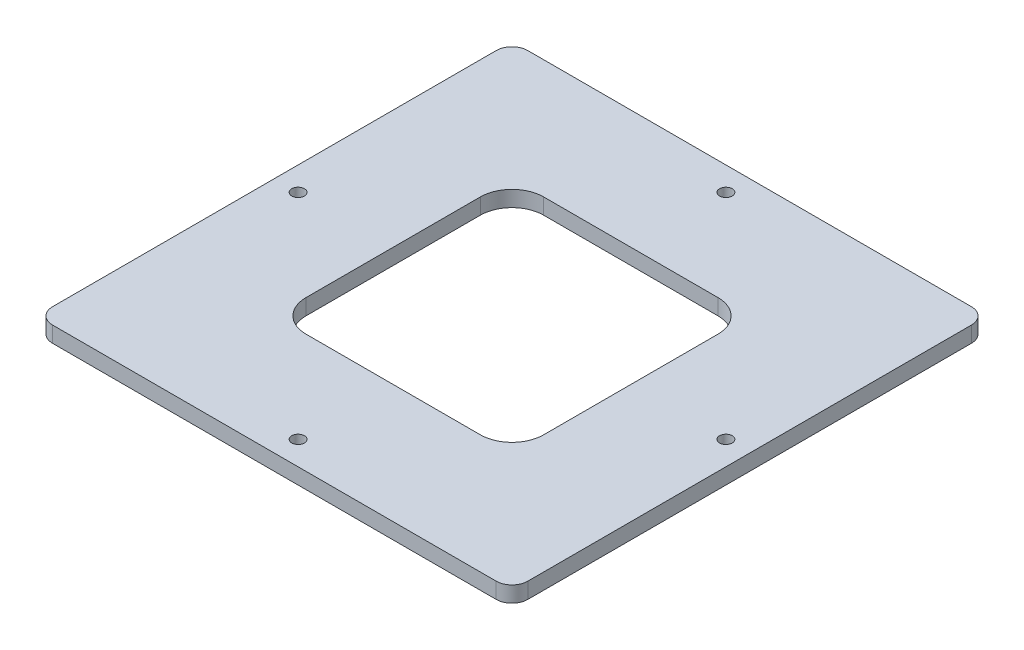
ISO-10303-21;
HEADER;
FILE_DESCRIPTION(('STEP AP214'),'2;1');
FILE_NAME('part.step','',(''),(''),'','','');
FILE_SCHEMA(('AUTOMOTIVE_DESIGN { 1 0 10303 214 1 1 1 1 }'));
ENDSEC;
DATA;
#1=APPLICATION_CONTEXT('core data for automotive mechanical design processes');
#2=APPLICATION_PROTOCOL_DEFINITION('international standard','automotive_design',2000,#1);
#3=PRODUCT_CONTEXT('',#1,'mechanical');
#4=PRODUCT('Part','Part','',(#3));
#5=PRODUCT_RELATED_PRODUCT_CATEGORY('part','',(#4));
#6=PRODUCT_DEFINITION_FORMATION('','',#4);
#7=PRODUCT_DEFINITION_CONTEXT('part definition',#1,'design');
#8=PRODUCT_DEFINITION('design','',#6,#7);
#9=PRODUCT_DEFINITION_SHAPE('','',#8);
#10=(LENGTH_UNIT() NAMED_UNIT(*) SI_UNIT(.MILLI.,.METRE.));
#11=(NAMED_UNIT(*) PLANE_ANGLE_UNIT() SI_UNIT($,.RADIAN.));
#12=(NAMED_UNIT(*) SI_UNIT($,.STERADIAN.) SOLID_ANGLE_UNIT());
#13=UNCERTAINTY_MEASURE_WITH_UNIT(LENGTH_MEASURE(1.E-05),#10,'distance_accuracy_value','');
#14=(GEOMETRIC_REPRESENTATION_CONTEXT(3) GLOBAL_UNCERTAINTY_ASSIGNED_CONTEXT((#13)) GLOBAL_UNIT_ASSIGNED_CONTEXT((#10,
#11,#12)) REPRESENTATION_CONTEXT('',''));
#15=CARTESIAN_POINT('',(0.,0.,0.));
#16=DIRECTION('',(0.,0.,1.));
#17=DIRECTION('',(1.,0.,0.));
#18=AXIS2_PLACEMENT_3D('',#15,#16,#17);
#19=CARTESIAN_POINT('',(-56.,4.,56.));
#20=DIRECTION('',(0.,1.,0.));
#21=DIRECTION('',(0.,0.,1.));
#22=AXIS2_PLACEMENT_3D('',#19,#20,#21);
#23=PLANE('',#22);
#24=CARTESIAN_POINT('',(0.,4.,54.));
#25=DIRECTION('',(0.,1.,0.));
#26=DIRECTION('',(0.,0.,1.));
#27=AXIS2_PLACEMENT_3D('',#24,#25,#26);
#28=CIRCLE('',#27,1.6);
#29=CARTESIAN_POINT('',(0.,4.,55.6));
#30=VERTEX_POINT('',#29);
#31=EDGE_CURVE('E389',#30,#30,#28,.T.);
#32=ORIENTED_EDGE('',*,*,#31,.F.);
#33=EDGE_LOOP('',(#32));
#34=FACE_BOUND('',#33,.T.);
#35=CARTESIAN_POINT('',(0.,4.,-54.));
#36=DIRECTION('',(0.,1.,0.));
#37=DIRECTION('',(0.,0.,1.));
#38=AXIS2_PLACEMENT_3D('',#35,#36,#37);
#39=CIRCLE('',#38,1.6);
#40=CARTESIAN_POINT('',(0.,4.,-52.4));
#41=VERTEX_POINT('',#40);
#42=EDGE_CURVE('E184',#41,#41,#39,.T.);
#43=ORIENTED_EDGE('',*,*,#42,.F.);
#44=EDGE_LOOP('',(#43));
#45=FACE_BOUND('',#44,.T.);
#46=CARTESIAN_POINT('',(-56.,4.,56.));
#47=DIRECTION('',(0.,1.,0.));
#48=DIRECTION('',(0.,0.,1.));
#49=AXIS2_PLACEMENT_3D('',#46,#47,#48);
#50=CIRCLE('',#49,4.00000000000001);
#51=CARTESIAN_POINT('',(-60.,4.,56.));
#52=VERTEX_POINT('',#51);
#53=CARTESIAN_POINT('',(-56.,4.,60.));
#54=VERTEX_POINT('',#53);
#55=EDGE_CURVE('E214',#52,#54,#50,.T.);
#56=ORIENTED_EDGE('',*,*,#55,.T.);
#57=DIRECTION('',(1.,0.,0.));
#58=VECTOR('',#57,1.);
#59=CARTESIAN_POINT('',(-56.,4.,60.));
#60=LINE('',#59,#58);
#61=CARTESIAN_POINT('',(56.,4.,60.));
#62=VERTEX_POINT('',#61);
#63=EDGE_CURVE('E217',#54,#62,#60,.T.);
#64=ORIENTED_EDGE('',*,*,#63,.T.);
#65=CARTESIAN_POINT('',(56.,4.,56.));
#66=DIRECTION('',(0.,1.,0.));
#67=DIRECTION('',(0.,0.,-1.));
#68=AXIS2_PLACEMENT_3D('',#65,#66,#67);
#69=CIRCLE('',#68,4.00000000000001);
#70=CARTESIAN_POINT('',(60.,4.,56.));
#71=VERTEX_POINT('',#70);
#72=EDGE_CURVE('E220',#62,#71,#69,.T.);
#73=ORIENTED_EDGE('',*,*,#72,.T.);
#74=DIRECTION('',(0.,0.,-1.));
#75=VECTOR('',#74,1.);
#76=CARTESIAN_POINT('',(60.,4.,-56.));
#77=LINE('',#76,#75);
#78=CARTESIAN_POINT('',(60.,4.,-56.));
#79=VERTEX_POINT('',#78);
#80=EDGE_CURVE('E222',#71,#79,#77,.T.);
#81=ORIENTED_EDGE('',*,*,#80,.T.);
#82=CARTESIAN_POINT('',(56.,4.,-56.));
#83=DIRECTION('',(0.,1.,0.));
#84=DIRECTION('',(0.,0.,-1.));
#85=AXIS2_PLACEMENT_3D('',#82,#83,#84);
#86=CIRCLE('',#85,4.00000000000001);
#87=CARTESIAN_POINT('',(56.,4.,-60.));
#88=VERTEX_POINT('',#87);
#89=EDGE_CURVE('E224',#79,#88,#86,.T.);
#90=ORIENTED_EDGE('',*,*,#89,.T.);
#91=DIRECTION('',(-1.,0.,0.));
#92=VECTOR('',#91,1.);
#93=CARTESIAN_POINT('',(-56.,4.,-60.));
#94=LINE('',#93,#92);
#95=CARTESIAN_POINT('',(-56.,4.,-60.));
#96=VERTEX_POINT('',#95);
#97=EDGE_CURVE('E226',#88,#96,#94,.T.);
#98=ORIENTED_EDGE('',*,*,#97,.T.);
#99=CARTESIAN_POINT('',(-56.,4.,-56.));
#100=DIRECTION('',(0.,1.,0.));
#101=DIRECTION('',(0.,0.,1.));
#102=AXIS2_PLACEMENT_3D('',#99,#100,#101);
#103=CIRCLE('',#102,4.00000000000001);
#104=CARTESIAN_POINT('',(-60.,4.,-56.));
#105=VERTEX_POINT('',#104);
#106=EDGE_CURVE('E228',#96,#105,#103,.T.);
#107=ORIENTED_EDGE('',*,*,#106,.T.);
#108=DIRECTION('',(0.,0.,1.));
#109=VECTOR('',#108,1.);
#110=CARTESIAN_POINT('',(-60.,4.,-56.));
#111=LINE('',#110,#109);
#112=EDGE_CURVE('E230',#105,#52,#111,.T.);
#113=ORIENTED_EDGE('',*,*,#112,.T.);
#114=EDGE_LOOP('',(#56,#64,#73,#81,#90,#98,#107,#113));
#115=FACE_BOUND('',#114,.T.);
#116=DIRECTION('',(1.,0.,0.));
#117=VECTOR('',#116,1.);
#118=CARTESIAN_POINT('',(-22.,4.,30.));
#119=LINE('',#118,#117);
#120=CARTESIAN_POINT('',(-22.,4.,30.));
#121=VERTEX_POINT('',#120);
#122=CARTESIAN_POINT('',(22.,4.,30.));
#123=VERTEX_POINT('',#122);
#124=EDGE_CURVE('E154',#121,#123,#119,.T.);
#125=ORIENTED_EDGE('',*,*,#124,.F.);
#126=CARTESIAN_POINT('',(-22.,4.,22.));
#127=DIRECTION('',(0.,1.,0.));
#128=DIRECTION('',(0.,0.,-1.));
#129=AXIS2_PLACEMENT_3D('',#126,#127,#128);
#130=CIRCLE('',#129,8.);
#131=CARTESIAN_POINT('',(-30.,4.,22.));
#132=VERTEX_POINT('',#131);
#133=EDGE_CURVE('E146',#132,#121,#130,.T.);
#134=ORIENTED_EDGE('',*,*,#133,.F.);
#135=DIRECTION('',(0.,0.,1.));
#136=VECTOR('',#135,1.);
#137=CARTESIAN_POINT('',(-30.,4.,-22.));
#138=LINE('',#137,#136);
#139=CARTESIAN_POINT('',(-30.,4.,-22.));
#140=VERTEX_POINT('',#139);
#141=EDGE_CURVE('E181',#140,#132,#138,.T.);
#142=ORIENTED_EDGE('',*,*,#141,.F.);
#143=CARTESIAN_POINT('',(-22.,4.,-22.));
#144=DIRECTION('',(0.,1.,0.));
#145=DIRECTION('',(0.,0.,1.));
#146=AXIS2_PLACEMENT_3D('',#143,#144,#145);
#147=CIRCLE('',#146,8.);
#148=CARTESIAN_POINT('',(-22.,4.,-30.));
#149=VERTEX_POINT('',#148);
#150=EDGE_CURVE('E179',#149,#140,#147,.T.);
#151=ORIENTED_EDGE('',*,*,#150,.F.);
#152=DIRECTION('',(-1.,0.,0.));
#153=VECTOR('',#152,1.);
#154=CARTESIAN_POINT('',(-22.,4.,-30.));
#155=LINE('',#154,#153);
#156=CARTESIAN_POINT('',(22.,4.,-30.));
#157=VERTEX_POINT('',#156);
#158=EDGE_CURVE('E177',#157,#149,#155,.T.);
#159=ORIENTED_EDGE('',*,*,#158,.F.);
#160=CARTESIAN_POINT('',(22.,4.,-22.));
#161=DIRECTION('',(0.,1.,0.));
#162=DIRECTION('',(0.,0.,1.));
#163=AXIS2_PLACEMENT_3D('',#160,#161,#162);
#164=CIRCLE('',#163,8.);
#165=CARTESIAN_POINT('',(30.,4.,-22.));
#166=VERTEX_POINT('',#165);
#167=EDGE_CURVE('E175',#166,#157,#164,.T.);
#168=ORIENTED_EDGE('',*,*,#167,.F.);
#169=DIRECTION('',(0.,0.,-1.));
#170=VECTOR('',#169,1.);
#171=CARTESIAN_POINT('',(30.,4.,-22.));
#172=LINE('',#171,#170);
#173=CARTESIAN_POINT('',(30.,4.,22.));
#174=VERTEX_POINT('',#173);
#175=EDGE_CURVE('E170',#174,#166,#172,.T.);
#176=ORIENTED_EDGE('',*,*,#175,.F.);
#177=CARTESIAN_POINT('',(22.,4.,22.));
#178=DIRECTION('',(0.,1.,0.));
#179=DIRECTION('',(0.,0.,1.));
#180=AXIS2_PLACEMENT_3D('',#177,#178,#179);
#181=CIRCLE('',#180,8.);
#182=EDGE_CURVE('E168',#123,#174,#181,.T.);
#183=ORIENTED_EDGE('',*,*,#182,.F.);
#184=EDGE_LOOP('',(#125,#134,#142,#151,#159,#168,#176,#183));
#185=FACE_BOUND('',#184,.T.);
#186=CARTESIAN_POINT('',(54.,4.,0.));
#187=DIRECTION('',(0.,1.,0.));
#188=DIRECTION('',(0.,0.,1.));
#189=AXIS2_PLACEMENT_3D('',#186,#187,#188);
#190=CIRCLE('',#189,1.60000000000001);
#191=CARTESIAN_POINT('',(54.,4.,1.6));
#192=VERTEX_POINT('',#191);
#193=EDGE_CURVE('E395',#192,#192,#190,.T.);
#194=ORIENTED_EDGE('',*,*,#193,.F.);
#195=EDGE_LOOP('',(#194));
#196=FACE_BOUND('',#195,.T.);
#197=CARTESIAN_POINT('',(-54.,4.,0.));
#198=DIRECTION('',(0.,1.,0.));
#199=DIRECTION('',(0.,0.,1.));
#200=AXIS2_PLACEMENT_3D('',#197,#198,#199);
#201=CIRCLE('',#200,1.6);
#202=CARTESIAN_POINT('',(-54.,4.,1.60000000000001));
#203=VERTEX_POINT('',#202);
#204=EDGE_CURVE('E380',#203,#203,#201,.T.);
#205=ORIENTED_EDGE('',*,*,#204,.F.);
#206=EDGE_LOOP('',(#205));
#207=FACE_BOUND('',#206,.T.);
#208=ADVANCED_FACE('F33',(#34,#45,#115,#185,#196,#207),#23,.T.);
#209=CARTESIAN_POINT('',(-56.,0.,56.));
#210=DIRECTION('',(0.,1.,0.));
#211=DIRECTION('',(0.,0.,1.));
#212=AXIS2_PLACEMENT_3D('',#209,#210,#211);
#213=PLANE('',#212);
#214=CARTESIAN_POINT('',(0.,0.,54.));
#215=DIRECTION('',(0.,1.,0.));
#216=DIRECTION('',(0.,0.,1.));
#217=AXIS2_PLACEMENT_3D('',#214,#215,#216);
#218=CIRCLE('',#217,1.6);
#219=CARTESIAN_POINT('',(0.,0.,55.6));
#220=VERTEX_POINT('',#219);
#221=EDGE_CURVE('E386',#220,#220,#218,.T.);
#222=ORIENTED_EDGE('',*,*,#221,.T.);
#223=EDGE_LOOP('',(#222));
#224=FACE_BOUND('',#223,.T.);
#225=CARTESIAN_POINT('',(0.,0.,-54.));
#226=DIRECTION('',(0.,1.,0.));
#227=DIRECTION('',(0.,0.,1.));
#228=AXIS2_PLACEMENT_3D('',#225,#226,#227);
#229=CIRCLE('',#228,1.6);
#230=CARTESIAN_POINT('',(0.,0.,-52.4));
#231=VERTEX_POINT('',#230);
#232=EDGE_CURVE('E398',#231,#231,#229,.T.);
#233=ORIENTED_EDGE('',*,*,#232,.T.);
#234=EDGE_LOOP('',(#233));
#235=FACE_BOUND('',#234,.T.);
#236=CARTESIAN_POINT('',(-56.,0.,56.));
#237=DIRECTION('',(0.,1.,0.));
#238=DIRECTION('',(0.,0.,1.));
#239=AXIS2_PLACEMENT_3D('',#236,#237,#238);
#240=CIRCLE('',#239,4.00000000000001);
#241=CARTESIAN_POINT('',(-60.,0.,56.));
#242=VERTEX_POINT('',#241);
#243=CARTESIAN_POINT('',(-56.,0.,60.));
#244=VERTEX_POINT('',#243);
#245=EDGE_CURVE('E162',#242,#244,#240,.T.);
#246=ORIENTED_EDGE('',*,*,#245,.F.);
#247=DIRECTION('',(0.,0.,1.));
#248=VECTOR('',#247,1.);
#249=CARTESIAN_POINT('',(-60.,0.,-56.));
#250=LINE('',#249,#248);
#251=CARTESIAN_POINT('',(-60.,0.,-56.));
#252=VERTEX_POINT('',#251);
#253=EDGE_CURVE('E218',#252,#242,#250,.T.);
#254=ORIENTED_EDGE('',*,*,#253,.F.);
#255=CARTESIAN_POINT('',(-56.,0.,-56.));
#256=DIRECTION('',(0.,1.,0.));
#257=DIRECTION('',(0.,0.,1.));
#258=AXIS2_PLACEMENT_3D('',#255,#256,#257);
#259=CIRCLE('',#258,4.00000000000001);
#260=CARTESIAN_POINT('',(-56.,0.,-60.));
#261=VERTEX_POINT('',#260);
#262=EDGE_CURVE('E245',#261,#252,#259,.T.);
#263=ORIENTED_EDGE('',*,*,#262,.F.);
#264=DIRECTION('',(-1.,0.,0.));
#265=VECTOR('',#264,1.);
#266=CARTESIAN_POINT('',(-56.,0.,-60.));
#267=LINE('',#266,#265);
#268=CARTESIAN_POINT('',(56.,0.,-60.));
#269=VERTEX_POINT('',#268);
#270=EDGE_CURVE('E243',#269,#261,#267,.T.);
#271=ORIENTED_EDGE('',*,*,#270,.F.);
#272=CARTESIAN_POINT('',(56.,0.,-56.));
#273=DIRECTION('',(0.,1.,0.));
#274=DIRECTION('',(0.,0.,-1.));
#275=AXIS2_PLACEMENT_3D('',#272,#273,#274);
#276=CIRCLE('',#275,4.00000000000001);
#277=CARTESIAN_POINT('',(60.,0.,-56.));
#278=VERTEX_POINT('',#277);
#279=EDGE_CURVE('E241',#278,#269,#276,.T.);
#280=ORIENTED_EDGE('',*,*,#279,.F.);
#281=DIRECTION('',(0.,0.,-1.));
#282=VECTOR('',#281,1.);
#283=CARTESIAN_POINT('',(60.,0.,-56.));
#284=LINE('',#283,#282);
#285=CARTESIAN_POINT('',(60.,0.,56.));
#286=VERTEX_POINT('',#285);
#287=EDGE_CURVE('E239',#286,#278,#284,.T.);
#288=ORIENTED_EDGE('',*,*,#287,.F.);
#289=CARTESIAN_POINT('',(56.,0.,56.));
#290=DIRECTION('',(0.,1.,0.));
#291=DIRECTION('',(0.,0.,-1.));
#292=AXIS2_PLACEMENT_3D('',#289,#290,#291);
#293=CIRCLE('',#292,4.00000000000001);
#294=CARTESIAN_POINT('',(56.,0.,60.));
#295=VERTEX_POINT('',#294);
#296=EDGE_CURVE('E237',#295,#286,#293,.T.);
#297=ORIENTED_EDGE('',*,*,#296,.F.);
#298=DIRECTION('',(1.,0.,0.));
#299=VECTOR('',#298,1.);
#300=CARTESIAN_POINT('',(-56.,0.,60.));
#301=LINE('',#300,#299);
#302=EDGE_CURVE('E235',#244,#295,#301,.T.);
#303=ORIENTED_EDGE('',*,*,#302,.F.);
#304=EDGE_LOOP('',(#246,#254,#263,#271,#280,#288,#297,#303));
#305=FACE_BOUND('',#304,.T.);
#306=CARTESIAN_POINT('',(-22.,0.,22.));
#307=DIRECTION('',(0.,1.,0.));
#308=DIRECTION('',(0.,0.,-1.));
#309=AXIS2_PLACEMENT_3D('',#306,#307,#308);
#310=CIRCLE('',#309,8.);
#311=CARTESIAN_POINT('',(-30.,0.,22.));
#312=VERTEX_POINT('',#311);
#313=CARTESIAN_POINT('',(-22.,0.,30.));
#314=VERTEX_POINT('',#313);
#315=EDGE_CURVE('E56',#312,#314,#310,.T.);
#316=ORIENTED_EDGE('',*,*,#315,.T.);
#317=DIRECTION('',(1.,0.,0.));
#318=VECTOR('',#317,1.);
#319=CARTESIAN_POINT('',(-22.,0.,30.));
#320=LINE('',#319,#318);
#321=CARTESIAN_POINT('',(22.,0.,30.));
#322=VERTEX_POINT('',#321);
#323=EDGE_CURVE('E161',#314,#322,#320,.T.);
#324=ORIENTED_EDGE('',*,*,#323,.T.);
#325=CARTESIAN_POINT('',(22.,0.,22.));
#326=DIRECTION('',(0.,1.,0.));
#327=DIRECTION('',(0.,0.,1.));
#328=AXIS2_PLACEMENT_3D('',#325,#326,#327);
#329=CIRCLE('',#328,8.);
#330=CARTESIAN_POINT('',(30.,0.,22.));
#331=VERTEX_POINT('',#330);
#332=EDGE_CURVE('E186',#322,#331,#329,.T.);
#333=ORIENTED_EDGE('',*,*,#332,.T.);
#334=DIRECTION('',(0.,0.,-1.));
#335=VECTOR('',#334,1.);
#336=CARTESIAN_POINT('',(30.,0.,-22.));
#337=LINE('',#336,#335);
#338=CARTESIAN_POINT('',(30.,0.,-22.));
#339=VERTEX_POINT('',#338);
#340=EDGE_CURVE('E189',#331,#339,#337,.T.);
#341=ORIENTED_EDGE('',*,*,#340,.T.);
#342=CARTESIAN_POINT('',(22.,0.,-22.));
#343=DIRECTION('',(0.,1.,0.));
#344=DIRECTION('',(0.,0.,1.));
#345=AXIS2_PLACEMENT_3D('',#342,#343,#344);
#346=CIRCLE('',#345,8.);
#347=CARTESIAN_POINT('',(22.,0.,-30.));
#348=VERTEX_POINT('',#347);
#349=EDGE_CURVE('E192',#339,#348,#346,.T.);
#350=ORIENTED_EDGE('',*,*,#349,.T.);
#351=DIRECTION('',(-1.,0.,0.));
#352=VECTOR('',#351,1.);
#353=CARTESIAN_POINT('',(-22.,0.,-30.));
#354=LINE('',#353,#352);
#355=CARTESIAN_POINT('',(-22.,0.,-30.));
#356=VERTEX_POINT('',#355);
#357=EDGE_CURVE('E195',#348,#356,#354,.T.);
#358=ORIENTED_EDGE('',*,*,#357,.T.);
#359=CARTESIAN_POINT('',(-22.,0.,-22.));
#360=DIRECTION('',(0.,1.,0.));
#361=DIRECTION('',(0.,0.,1.));
#362=AXIS2_PLACEMENT_3D('',#359,#360,#361);
#363=CIRCLE('',#362,8.);
#364=CARTESIAN_POINT('',(-30.,0.,-22.));
#365=VERTEX_POINT('',#364);
#366=EDGE_CURVE('E198',#356,#365,#363,.T.);
#367=ORIENTED_EDGE('',*,*,#366,.T.);
#368=DIRECTION('',(0.,0.,1.));
#369=VECTOR('',#368,1.);
#370=CARTESIAN_POINT('',(-30.,0.,-22.));
#371=LINE('',#370,#369);
#372=EDGE_CURVE('E155',#365,#312,#371,.T.);
#373=ORIENTED_EDGE('',*,*,#372,.T.);
#374=EDGE_LOOP('',(#316,#324,#333,#341,#350,#358,#367,#373));
#375=FACE_BOUND('',#374,.T.);
#376=CARTESIAN_POINT('',(54.,0.,0.));
#377=DIRECTION('',(0.,1.,0.));
#378=DIRECTION('',(0.,0.,1.));
#379=AXIS2_PLACEMENT_3D('',#376,#377,#378);
#380=CIRCLE('',#379,1.60000000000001);
#381=CARTESIAN_POINT('',(54.,0.,1.6));
#382=VERTEX_POINT('',#381);
#383=EDGE_CURVE('E392',#382,#382,#380,.T.);
#384=ORIENTED_EDGE('',*,*,#383,.T.);
#385=EDGE_LOOP('',(#384));
#386=FACE_BOUND('',#385,.T.);
#387=CARTESIAN_POINT('',(-54.,0.,0.));
#388=DIRECTION('',(0.,1.,0.));
#389=DIRECTION('',(0.,0.,1.));
#390=AXIS2_PLACEMENT_3D('',#387,#388,#389);
#391=CIRCLE('',#390,1.6);
#392=CARTESIAN_POINT('',(-54.,0.,1.60000000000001));
#393=VERTEX_POINT('',#392);
#394=EDGE_CURVE('E383',#393,#393,#391,.T.);
#395=ORIENTED_EDGE('',*,*,#394,.T.);
#396=EDGE_LOOP('',(#395));
#397=FACE_BOUND('',#396,.T.);
#398=ADVANCED_FACE('F275',(#224,#235,#305,#375,#386,#397),#213,.F.);
#399=CARTESIAN_POINT('',(-56.,4.,56.));
#400=DIRECTION('',(0.,-1.,0.));
#401=DIRECTION('',(0.,0.,-1.));
#402=AXIS2_PLACEMENT_3D('',#399,#400,#401);
#403=CYLINDRICAL_SURFACE('',#402,4.00000000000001);
#404=ORIENTED_EDGE('',*,*,#245,.T.);
#405=DIRECTION('',(0.,-1.,0.));
#406=VECTOR('',#405,1.);
#407=CARTESIAN_POINT('',(-56.,4.,60.));
#408=LINE('',#407,#406);
#409=EDGE_CURVE('E11',#54,#244,#408,.T.);
#410=ORIENTED_EDGE('',*,*,#409,.F.);
#411=ORIENTED_EDGE('',*,*,#55,.F.);
#412=DIRECTION('',(0.,-1.,0.));
#413=VECTOR('',#412,1.);
#414=CARTESIAN_POINT('',(-60.,4.,56.));
#415=LINE('',#414,#413);
#416=EDGE_CURVE('E232',#52,#242,#415,.T.);
#417=ORIENTED_EDGE('',*,*,#416,.T.);
#418=EDGE_LOOP('',(#404,#410,#411,#417));
#419=FACE_BOUND('',#418,.T.);
#420=ADVANCED_FACE('F35',(#419),#403,.T.);
#421=CARTESIAN_POINT('',(-56.,4.,60.));
#422=DIRECTION('',(0.,0.,-1.));
#423=DIRECTION('',(-1.,0.,0.));
#424=AXIS2_PLACEMENT_3D('',#421,#422,#423);
#425=PLANE('',#424);
#426=ORIENTED_EDGE('',*,*,#302,.T.);
#427=DIRECTION('',(0.,-1.,0.));
#428=VECTOR('',#427,1.);
#429=CARTESIAN_POINT('',(56.,4.,60.));
#430=LINE('',#429,#428);
#431=EDGE_CURVE('E41',#62,#295,#430,.T.);
#432=ORIENTED_EDGE('',*,*,#431,.F.);
#433=ORIENTED_EDGE('',*,*,#63,.F.);
#434=ORIENTED_EDGE('',*,*,#409,.T.);
#435=EDGE_LOOP('',(#426,#432,#433,#434));
#436=FACE_BOUND('',#435,.T.);
#437=ADVANCED_FACE('F292',(#436),#425,.F.);
#438=CARTESIAN_POINT('',(56.,4.,56.));
#439=DIRECTION('',(0.,-1.,0.));
#440=DIRECTION('',(0.,0.,-1.));
#441=AXIS2_PLACEMENT_3D('',#438,#439,#440);
#442=CYLINDRICAL_SURFACE('',#441,4.00000000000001);
#443=ORIENTED_EDGE('',*,*,#296,.T.);
#444=DIRECTION('',(0.,-1.,0.));
#445=VECTOR('',#444,1.);
#446=CARTESIAN_POINT('',(60.,4.,56.));
#447=LINE('',#446,#445);
#448=EDGE_CURVE('E262',#71,#286,#447,.T.);
#449=ORIENTED_EDGE('',*,*,#448,.F.);
#450=ORIENTED_EDGE('',*,*,#72,.F.);
#451=ORIENTED_EDGE('',*,*,#431,.T.);
#452=EDGE_LOOP('',(#443,#449,#450,#451));
#453=FACE_BOUND('',#452,.T.);
#454=ADVANCED_FACE('F269',(#453),#442,.T.);
#455=CARTESIAN_POINT('',(60.,4.,-56.));
#456=DIRECTION('',(-1.,0.,0.));
#457=DIRECTION('',(0.,0.,1.));
#458=AXIS2_PLACEMENT_3D('',#455,#456,#457);
#459=PLANE('',#458);
#460=ORIENTED_EDGE('',*,*,#287,.T.);
#461=DIRECTION('',(0.,-1.,0.));
#462=VECTOR('',#461,1.);
#463=CARTESIAN_POINT('',(60.,4.,-56.));
#464=LINE('',#463,#462);
#465=EDGE_CURVE('E259',#79,#278,#464,.T.);
#466=ORIENTED_EDGE('',*,*,#465,.F.);
#467=ORIENTED_EDGE('',*,*,#80,.F.);
#468=ORIENTED_EDGE('',*,*,#448,.T.);
#469=EDGE_LOOP('',(#460,#466,#467,#468));
#470=FACE_BOUND('',#469,.T.);
#471=ADVANCED_FACE('F281',(#470),#459,.F.);
#472=CARTESIAN_POINT('',(56.,4.,-56.));
#473=DIRECTION('',(0.,-1.,0.));
#474=DIRECTION('',(0.,0.,-1.));
#475=AXIS2_PLACEMENT_3D('',#472,#473,#474);
#476=CYLINDRICAL_SURFACE('',#475,4.00000000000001);
#477=ORIENTED_EDGE('',*,*,#279,.T.);
#478=DIRECTION('',(0.,-1.,0.));
#479=VECTOR('',#478,1.);
#480=CARTESIAN_POINT('',(56.,4.,-60.));
#481=LINE('',#480,#479);
#482=EDGE_CURVE('E256',#88,#269,#481,.T.);
#483=ORIENTED_EDGE('',*,*,#482,.F.);
#484=ORIENTED_EDGE('',*,*,#89,.F.);
#485=ORIENTED_EDGE('',*,*,#465,.T.);
#486=EDGE_LOOP('',(#477,#483,#484,#485));
#487=FACE_BOUND('',#486,.T.);
#488=ADVANCED_FACE('F285',(#487),#476,.T.);
#489=CARTESIAN_POINT('',(-56.,4.,-60.));
#490=DIRECTION('',(0.,0.,1.));
#491=DIRECTION('',(1.,0.,0.));
#492=AXIS2_PLACEMENT_3D('',#489,#490,#491);
#493=PLANE('',#492);
#494=ORIENTED_EDGE('',*,*,#270,.T.);
#495=DIRECTION('',(0.,-1.,0.));
#496=VECTOR('',#495,1.);
#497=CARTESIAN_POINT('',(-56.,4.,-60.));
#498=LINE('',#497,#496);
#499=EDGE_CURVE('E253',#96,#261,#498,.T.);
#500=ORIENTED_EDGE('',*,*,#499,.F.);
#501=ORIENTED_EDGE('',*,*,#97,.F.);
#502=ORIENTED_EDGE('',*,*,#482,.T.);
#503=EDGE_LOOP('',(#494,#500,#501,#502));
#504=FACE_BOUND('',#503,.T.);
#505=ADVANCED_FACE('F305',(#504),#493,.F.);
#506=CARTESIAN_POINT('',(-56.,4.,-56.));
#507=DIRECTION('',(0.,-1.,0.));
#508=DIRECTION('',(0.,0.,-1.));
#509=AXIS2_PLACEMENT_3D('',#506,#507,#508);
#510=CYLINDRICAL_SURFACE('',#509,4.00000000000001);
#511=ORIENTED_EDGE('',*,*,#262,.T.);
#512=DIRECTION('',(0.,-1.,0.));
#513=VECTOR('',#512,1.);
#514=CARTESIAN_POINT('',(-60.,4.,-56.));
#515=LINE('',#514,#513);
#516=EDGE_CURVE('E250',#105,#252,#515,.T.);
#517=ORIENTED_EDGE('',*,*,#516,.F.);
#518=ORIENTED_EDGE('',*,*,#106,.F.);
#519=ORIENTED_EDGE('',*,*,#499,.T.);
#520=EDGE_LOOP('',(#511,#517,#518,#519));
#521=FACE_BOUND('',#520,.T.);
#522=ADVANCED_FACE('F303',(#521),#510,.T.);
#523=CARTESIAN_POINT('',(-60.,4.,-56.));
#524=DIRECTION('',(1.,0.,0.));
#525=DIRECTION('',(0.,0.,-1.));
#526=AXIS2_PLACEMENT_3D('',#523,#524,#525);
#527=PLANE('',#526);
#528=ORIENTED_EDGE('',*,*,#253,.T.);
#529=ORIENTED_EDGE('',*,*,#416,.F.);
#530=ORIENTED_EDGE('',*,*,#112,.F.);
#531=ORIENTED_EDGE('',*,*,#516,.T.);
#532=EDGE_LOOP('',(#528,#529,#530,#531));
#533=FACE_BOUND('',#532,.T.);
#534=ADVANCED_FACE('F298',(#533),#527,.F.);
#535=CARTESIAN_POINT('',(-22.,4.,22.));
#536=DIRECTION('',(0.,-1.,0.));
#537=DIRECTION('',(0.,0.,-1.));
#538=AXIS2_PLACEMENT_3D('',#535,#536,#537);
#539=CYLINDRICAL_SURFACE('',#538,8.);
#540=ORIENTED_EDGE('',*,*,#315,.F.);
#541=DIRECTION('',(0.,-1.,0.));
#542=VECTOR('',#541,1.);
#543=CARTESIAN_POINT('',(-30.,4.,22.));
#544=LINE('',#543,#542);
#545=EDGE_CURVE('E150',#132,#312,#544,.T.);
#546=ORIENTED_EDGE('',*,*,#545,.F.);
#547=ORIENTED_EDGE('',*,*,#133,.T.);
#548=DIRECTION('',(0.,-1.,0.));
#549=VECTOR('',#548,1.);
#550=CARTESIAN_POINT('',(-22.,4.,30.));
#551=LINE('',#550,#549);
#552=EDGE_CURVE('E149',#121,#314,#551,.T.);
#553=ORIENTED_EDGE('',*,*,#552,.T.);
#554=EDGE_LOOP('',(#540,#546,#547,#553));
#555=FACE_BOUND('',#554,.T.);
#556=ADVANCED_FACE('F148',(#555),#539,.F.);
#557=CARTESIAN_POINT('',(-22.,4.,30.));
#558=DIRECTION('',(0.,0.,-1.));
#559=DIRECTION('',(-1.,0.,0.));
#560=AXIS2_PLACEMENT_3D('',#557,#558,#559);
#561=PLANE('',#560);
#562=ORIENTED_EDGE('',*,*,#323,.F.);
#563=ORIENTED_EDGE('',*,*,#552,.F.);
#564=ORIENTED_EDGE('',*,*,#124,.T.);
#565=DIRECTION('',(0.,-1.,0.));
#566=VECTOR('',#565,1.);
#567=CARTESIAN_POINT('',(22.,4.,30.));
#568=LINE('',#567,#566);
#569=EDGE_CURVE('E163',#123,#322,#568,.T.);
#570=ORIENTED_EDGE('',*,*,#569,.T.);
#571=EDGE_LOOP('',(#562,#563,#564,#570));
#572=FACE_BOUND('',#571,.T.);
#573=ADVANCED_FACE('F158',(#572),#561,.T.);
#574=CARTESIAN_POINT('',(22.,4.,22.));
#575=DIRECTION('',(0.,-1.,0.));
#576=DIRECTION('',(0.,0.,-1.));
#577=AXIS2_PLACEMENT_3D('',#574,#575,#576);
#578=CYLINDRICAL_SURFACE('',#577,8.);
#579=ORIENTED_EDGE('',*,*,#332,.F.);
#580=ORIENTED_EDGE('',*,*,#569,.F.);
#581=ORIENTED_EDGE('',*,*,#182,.T.);
#582=DIRECTION('',(0.,-1.,0.));
#583=VECTOR('',#582,1.);
#584=CARTESIAN_POINT('',(30.,4.,22.));
#585=LINE('',#584,#583);
#586=EDGE_CURVE('E211',#174,#331,#585,.T.);
#587=ORIENTED_EDGE('',*,*,#586,.T.);
#588=EDGE_LOOP('',(#579,#580,#581,#587));
#589=FACE_BOUND('',#588,.T.);
#590=ADVANCED_FACE('F334',(#589),#578,.F.);
#591=CARTESIAN_POINT('',(30.,4.,-22.));
#592=DIRECTION('',(-1.,0.,0.));
#593=DIRECTION('',(0.,0.,1.));
#594=AXIS2_PLACEMENT_3D('',#591,#592,#593);
#595=PLANE('',#594);
#596=ORIENTED_EDGE('',*,*,#340,.F.);
#597=ORIENTED_EDGE('',*,*,#586,.F.);
#598=ORIENTED_EDGE('',*,*,#175,.T.);
#599=DIRECTION('',(0.,-1.,0.));
#600=VECTOR('',#599,1.);
#601=CARTESIAN_POINT('',(30.,4.,-22.));
#602=LINE('',#601,#600);
#603=EDGE_CURVE('E209',#166,#339,#602,.T.);
#604=ORIENTED_EDGE('',*,*,#603,.T.);
#605=EDGE_LOOP('',(#596,#597,#598,#604));
#606=FACE_BOUND('',#605,.T.);
#607=ADVANCED_FACE('F338',(#606),#595,.T.);
#608=CARTESIAN_POINT('',(22.,4.,-22.));
#609=DIRECTION('',(0.,-1.,0.));
#610=DIRECTION('',(0.,0.,-1.));
#611=AXIS2_PLACEMENT_3D('',#608,#609,#610);
#612=CYLINDRICAL_SURFACE('',#611,8.);
#613=ORIENTED_EDGE('',*,*,#349,.F.);
#614=ORIENTED_EDGE('',*,*,#603,.F.);
#615=ORIENTED_EDGE('',*,*,#167,.T.);
#616=DIRECTION('',(0.,-1.,0.));
#617=VECTOR('',#616,1.);
#618=CARTESIAN_POINT('',(22.,4.,-30.));
#619=LINE('',#618,#617);
#620=EDGE_CURVE('E207',#157,#348,#619,.T.);
#621=ORIENTED_EDGE('',*,*,#620,.T.);
#622=EDGE_LOOP('',(#613,#614,#615,#621));
#623=FACE_BOUND('',#622,.T.);
#624=ADVANCED_FACE('F344',(#623),#612,.F.);
#625=CARTESIAN_POINT('',(-22.,4.,-30.));
#626=DIRECTION('',(0.,0.,1.));
#627=DIRECTION('',(1.,0.,0.));
#628=AXIS2_PLACEMENT_3D('',#625,#626,#627);
#629=PLANE('',#628);
#630=ORIENTED_EDGE('',*,*,#357,.F.);
#631=ORIENTED_EDGE('',*,*,#620,.F.);
#632=ORIENTED_EDGE('',*,*,#158,.T.);
#633=DIRECTION('',(0.,-1.,0.));
#634=VECTOR('',#633,1.);
#635=CARTESIAN_POINT('',(-22.,4.,-30.));
#636=LINE('',#635,#634);
#637=EDGE_CURVE('E205',#149,#356,#636,.T.);
#638=ORIENTED_EDGE('',*,*,#637,.T.);
#639=EDGE_LOOP('',(#630,#631,#632,#638));
#640=FACE_BOUND('',#639,.T.);
#641=ADVANCED_FACE('F348',(#640),#629,.T.);
#642=CARTESIAN_POINT('',(-22.,4.,-22.));
#643=DIRECTION('',(0.,-1.,0.));
#644=DIRECTION('',(0.,0.,-1.));
#645=AXIS2_PLACEMENT_3D('',#642,#643,#644);
#646=CYLINDRICAL_SURFACE('',#645,8.);
#647=ORIENTED_EDGE('',*,*,#366,.F.);
#648=ORIENTED_EDGE('',*,*,#637,.F.);
#649=ORIENTED_EDGE('',*,*,#150,.T.);
#650=DIRECTION('',(0.,-1.,0.));
#651=VECTOR('',#650,1.);
#652=CARTESIAN_POINT('',(-30.,4.,-22.));
#653=LINE('',#652,#651);
#654=EDGE_CURVE('E48',#140,#365,#653,.T.);
#655=ORIENTED_EDGE('',*,*,#654,.T.);
#656=EDGE_LOOP('',(#647,#648,#649,#655));
#657=FACE_BOUND('',#656,.T.);
#658=ADVANCED_FACE('F352',(#657),#646,.F.);
#659=CARTESIAN_POINT('',(-30.,4.,-22.));
#660=DIRECTION('',(1.,0.,0.));
#661=DIRECTION('',(0.,0.,-1.));
#662=AXIS2_PLACEMENT_3D('',#659,#660,#661);
#663=PLANE('',#662);
#664=ORIENTED_EDGE('',*,*,#372,.F.);
#665=ORIENTED_EDGE('',*,*,#654,.F.);
#666=ORIENTED_EDGE('',*,*,#141,.T.);
#667=ORIENTED_EDGE('',*,*,#545,.T.);
#668=EDGE_LOOP('',(#664,#665,#666,#667));
#669=FACE_BOUND('',#668,.T.);
#670=ADVANCED_FACE('F356',(#669),#663,.T.);
#671=CARTESIAN_POINT('',(0.,4.,-54.));
#672=DIRECTION('',(0.,-1.,0.));
#673=DIRECTION('',(0.,0.,-1.));
#674=AXIS2_PLACEMENT_3D('',#671,#672,#673);
#675=CYLINDRICAL_SURFACE('',#674,1.6);
#676=ORIENTED_EDGE('',*,*,#42,.T.);
#677=EDGE_LOOP('',(#676));
#678=FACE_BOUND('',#677,.T.);
#679=ORIENTED_EDGE('',*,*,#232,.F.);
#680=EDGE_LOOP('',(#679));
#681=FACE_BOUND('',#680,.T.);
#682=ADVANCED_FACE('F360',(#678,#681),#675,.F.);
#683=CARTESIAN_POINT('',(54.,4.,0.));
#684=DIRECTION('',(0.,-1.,0.));
#685=DIRECTION('',(0.,0.,-1.));
#686=AXIS2_PLACEMENT_3D('',#683,#684,#685);
#687=CYLINDRICAL_SURFACE('',#686,1.60000000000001);
#688=ORIENTED_EDGE('',*,*,#193,.T.);
#689=EDGE_LOOP('',(#688));
#690=FACE_BOUND('',#689,.T.);
#691=ORIENTED_EDGE('',*,*,#383,.F.);
#692=EDGE_LOOP('',(#691));
#693=FACE_BOUND('',#692,.T.);
#694=ADVANCED_FACE('F363',(#690,#693),#687,.F.);
#695=CARTESIAN_POINT('',(0.,4.,54.));
#696=DIRECTION('',(0.,-1.,0.));
#697=DIRECTION('',(0.,0.,-1.));
#698=AXIS2_PLACEMENT_3D('',#695,#696,#697);
#699=CYLINDRICAL_SURFACE('',#698,1.6);
#700=ORIENTED_EDGE('',*,*,#31,.T.);
#701=EDGE_LOOP('',(#700));
#702=FACE_BOUND('',#701,.T.);
#703=ORIENTED_EDGE('',*,*,#221,.F.);
#704=EDGE_LOOP('',(#703));
#705=FACE_BOUND('',#704,.T.);
#706=ADVANCED_FACE('F367',(#702,#705),#699,.F.);
#707=CARTESIAN_POINT('',(-54.,4.,0.));
#708=DIRECTION('',(0.,-1.,0.));
#709=DIRECTION('',(0.,0.,-1.));
#710=AXIS2_PLACEMENT_3D('',#707,#708,#709);
#711=CYLINDRICAL_SURFACE('',#710,1.6);
#712=ORIENTED_EDGE('',*,*,#204,.T.);
#713=EDGE_LOOP('',(#712));
#714=FACE_BOUND('',#713,.T.);
#715=ORIENTED_EDGE('',*,*,#394,.F.);
#716=EDGE_LOOP('',(#715));
#717=FACE_BOUND('',#716,.T.);
#718=ADVANCED_FACE('F371',(#714,#717),#711,.F.);
#719=CLOSED_SHELL('',(#208,#398,#420,#437,#454,#471,#488,#505,#522,#534,#556,#573,#590,#607,
#624,#641,#658,#670,#682,#694,#706,#718));
#720=MANIFOLD_SOLID_BREP('B2',#719);
#721=ADVANCED_BREP_SHAPE_REPRESENTATION('',(#18,#720),#14);
#722=SHAPE_DEFINITION_REPRESENTATION(#9,#721);
ENDSEC;
END-ISO-10303-21;
